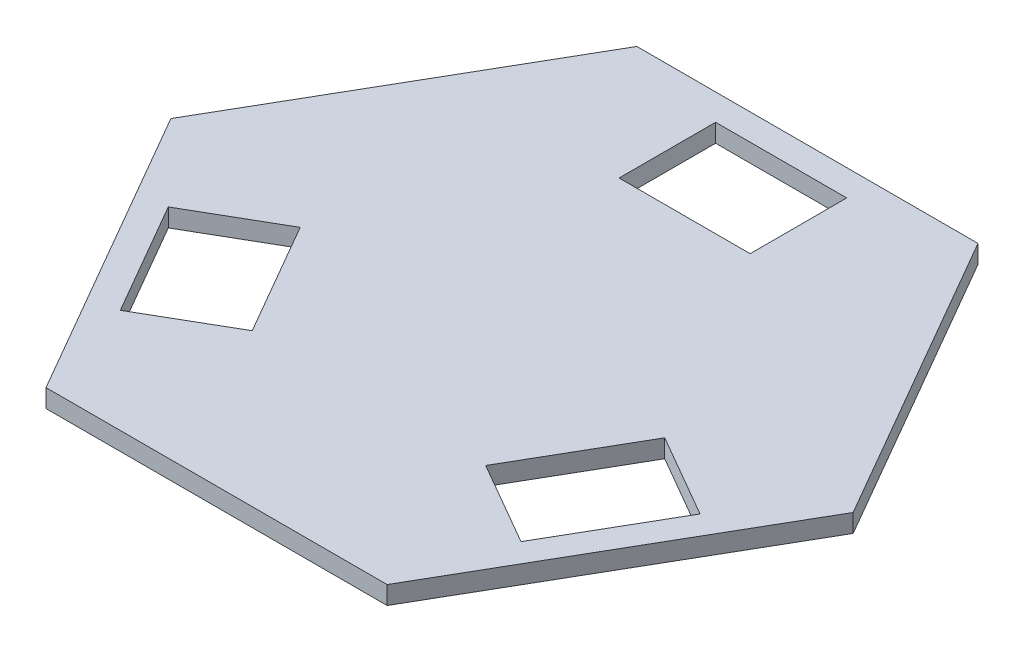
from build123d import *

# Parameters (mm, degrees)
SKETCH1_W           = 14.418453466
SKETCH1_H           = 10.621546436
BOSS_EXTRUDE1_DEPTH = 2


with BuildPart() as part:
    # Sketch1 → Boss-Extrude1 (new body)
    with BuildSketch(Plane(origin=(0, 0, 0), x_dir=(1, 0, 0), z_dir=(0, 1, 0))):
        Polygon((37.527767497, 0), (18.763883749, 32.5), (-18.763883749, 32.5), (-37.527767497, 0), (-18.763883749, -32.5), (18.763883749, -32.5), align=None)
        Polygon((22.039068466, -21.048760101), (29.248295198, -8.562013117), (20.049766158, -3.251239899), (12.840539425, -15.737986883), align=None, mode=Mode.SUBTRACT)
        with Locations((0, 24.3)):
            Rectangle(SKETCH1_W, SKETCH1_H, mode=Mode.SUBTRACT)
        Polygon((-29.248295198, -8.562013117), (-22.039068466, -21.048760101), (-12.840539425, -15.737986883), (-20.049766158, -3.251239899), align=None, mode=Mode.SUBTRACT)
    extrude(amount=BOSS_EXTRUDE1_DEPTH)


solid = part.part
